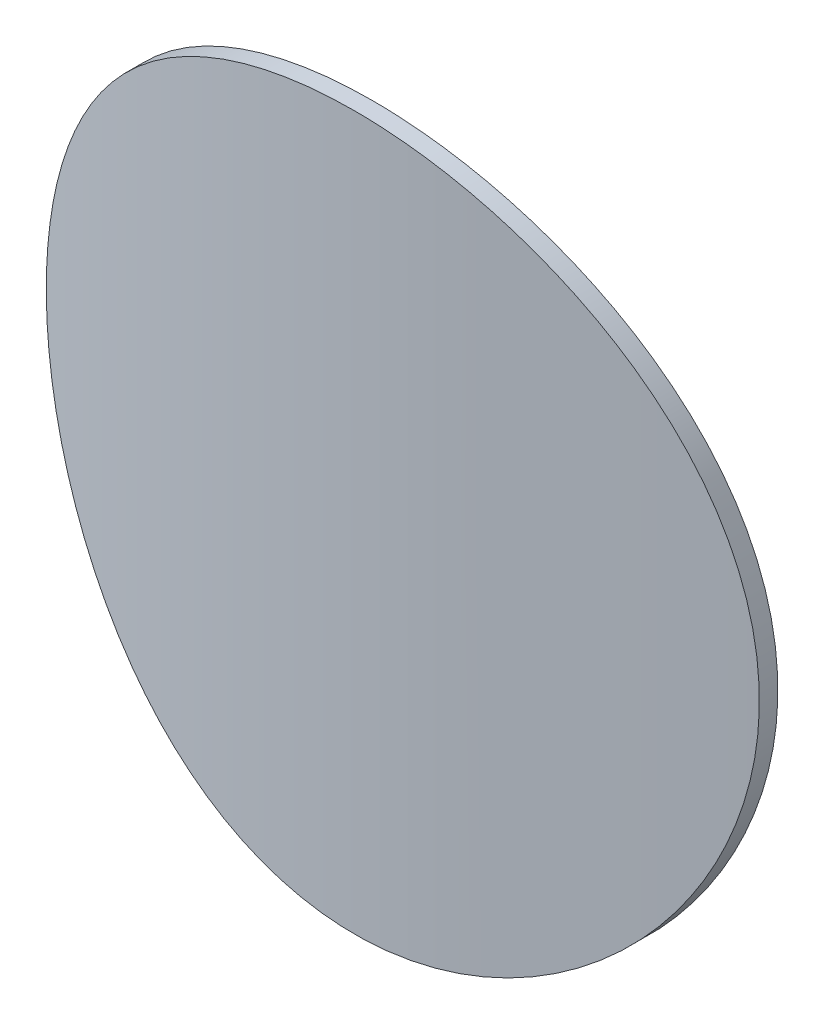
ISO-10303-21;
HEADER;
FILE_DESCRIPTION(('STEP AP214'),'2;1');
FILE_NAME('part.step','',(''),(''),'','','');
FILE_SCHEMA(('AUTOMOTIVE_DESIGN { 1 0 10303 214 1 1 1 1 }'));
ENDSEC;
DATA;
#1=APPLICATION_CONTEXT('core data for automotive mechanical design processes');
#2=APPLICATION_PROTOCOL_DEFINITION('international standard','automotive_design',2000,#1);
#3=PRODUCT_CONTEXT('',#1,'mechanical');
#4=PRODUCT('Part','Part','',(#3));
#5=PRODUCT_RELATED_PRODUCT_CATEGORY('part','',(#4));
#6=PRODUCT_DEFINITION_FORMATION('','',#4);
#7=PRODUCT_DEFINITION_CONTEXT('part definition',#1,'design');
#8=PRODUCT_DEFINITION('design','',#6,#7);
#9=PRODUCT_DEFINITION_SHAPE('','',#8);
#10=(LENGTH_UNIT() NAMED_UNIT(*) SI_UNIT(.MILLI.,.METRE.));
#11=(NAMED_UNIT(*) PLANE_ANGLE_UNIT() SI_UNIT($,.RADIAN.));
#12=(NAMED_UNIT(*) SI_UNIT($,.STERADIAN.) SOLID_ANGLE_UNIT());
#13=UNCERTAINTY_MEASURE_WITH_UNIT(LENGTH_MEASURE(1.E-05),#10,'distance_accuracy_value','');
#14=(GEOMETRIC_REPRESENTATION_CONTEXT(3) GLOBAL_UNCERTAINTY_ASSIGNED_CONTEXT((#13)) GLOBAL_UNIT_ASSIGNED_CONTEXT((#10,
#11,#12)) REPRESENTATION_CONTEXT('',''));
#15=CARTESIAN_POINT('',(0.,0.,0.));
#16=DIRECTION('',(0.,0.,1.));
#17=DIRECTION('',(1.,0.,0.));
#18=AXIS2_PLACEMENT_3D('',#15,#16,#17);
#19=CARTESIAN_POINT('',(0.,0.,63.5));
#20=DIRECTION('',(0.,0.,-1.));
#21=DIRECTION('',(-1.,0.,0.));
#22=AXIS2_PLACEMENT_3D('',#19,#20,#21);
#23=CYLINDRICAL_SURFACE('',#22,190.5);
#24=CARTESIAN_POINT('',(0.,190.5,0.));
#25=CARTESIAN_POINT('',(-2.62288411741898,190.49999868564,-7.754297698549E-07));
#26=CARTESIAN_POINT('',(-5.24582024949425,190.445819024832,-0.0145186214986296));
#27=CARTESIAN_POINT('',(-10.4871588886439,190.229204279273,-0.0724942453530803));
#28=CARTESIAN_POINT('',(-13.1055608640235,190.06675726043,-0.11595521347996));
#29=CARTESIAN_POINT('',(-18.3337459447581,189.633874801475,-0.2315387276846));
#30=CARTESIAN_POINT('',(-20.9435255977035,189.363400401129,-0.303671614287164));
#31=CARTESIAN_POINT('',(-26.1487752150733,188.715050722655,-0.476099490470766));
#32=CARTESIAN_POINT('',(-28.7442451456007,188.337175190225,-0.576394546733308));
#33=CARTESIAN_POINT('',(-33.9205032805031,187.474119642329,-0.804643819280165));
#34=CARTESIAN_POINT('',(-36.5012598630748,186.98876209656,-0.932643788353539));
#35=CARTESIAN_POINT('',(-41.6391282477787,185.912135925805,-1.21532232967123));
#36=CARTESIAN_POINT('',(-44.1962398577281,185.320866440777,-1.37000111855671));
#37=CARTESIAN_POINT('',(-49.2820039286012,184.033730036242,-1.70495579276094));
#38=CARTESIAN_POINT('',(-51.8106594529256,183.337874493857,-1.88522889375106));
#39=CARTESIAN_POINT('',(-56.8353843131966,181.842953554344,-2.27015286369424));
#40=CARTESIAN_POINT('',(-59.3314537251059,181.04388839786,-2.47480367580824));
#41=CARTESIAN_POINT('',(-64.2822161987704,179.345707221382,-2.90669939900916));
#42=CARTESIAN_POINT('',(-66.7369763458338,178.446776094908,-3.13390247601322));
#43=CARTESIAN_POINT('',(-71.6056404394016,176.549449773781,-3.60968427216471));
#44=CARTESIAN_POINT('',(-74.0195443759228,175.551054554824,-3.8582629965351));
#45=CARTESIAN_POINT('',(-78.8025474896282,173.456693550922,-4.37513853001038));
#46=CARTESIAN_POINT('',(-81.1716457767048,172.360725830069,-4.64343573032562));
#47=CARTESIAN_POINT('',(-85.861130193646,170.073284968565,-5.19795955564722));
#48=CARTESIAN_POINT('',(-88.1815163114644,168.881811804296,-5.48418618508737));
#49=CARTESIAN_POINT('',(-92.7691107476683,166.405931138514,-6.07257994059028));
#50=CARTESIAN_POINT('',(-95.0363360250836,165.121553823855,-6.37474188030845));
#51=CARTESIAN_POINT('',(-99.5150002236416,162.461683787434,-6.99313018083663));
#52=CARTESIAN_POINT('',(-101.726434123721,161.086182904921,-7.30935780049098));
#53=CARTESIAN_POINT('',(-106.089764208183,158.246602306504,-7.95376623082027));
#54=CARTESIAN_POINT('',(-108.24166269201,156.78252601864,-8.28194657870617));
#55=CARTESIAN_POINT('',(-112.482684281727,153.768214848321,-8.94812680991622));
#56=CARTESIAN_POINT('',(-114.571807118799,152.217979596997,-9.28612673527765));
#57=CARTESIAN_POINT('',(-118.727546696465,149.000237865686,-9.97696852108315));
#58=CARTESIAN_POINT('',(-120.792753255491,147.330944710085,-10.329973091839));
#59=CARTESIAN_POINT('',(-124.851065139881,143.907985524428,-11.0415209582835));
#60=CARTESIAN_POINT('',(-126.844169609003,142.154318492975,-11.4000643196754));
#61=CARTESIAN_POINT('',(-130.755088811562,138.565509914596,-12.1202474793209));
#62=CARTESIAN_POINT('',(-132.672902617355,136.730367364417,-12.4818873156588));
#63=CARTESIAN_POINT('',(-136.430112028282,132.981641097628,-13.2057845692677));
#64=CARTESIAN_POINT('',(-138.269508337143,131.068058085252,-13.5680419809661));
#65=CARTESIAN_POINT('',(-141.867248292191,127.165165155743,-14.2907583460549));
#66=CARTESIAN_POINT('',(-143.625576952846,125.175841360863,-14.6512169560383));
#67=CARTESIAN_POINT('',(-147.057927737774,121.124991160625,-15.3677791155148));
#68=CARTESIAN_POINT('',(-148.731949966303,119.063464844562,-15.7238826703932));
#69=CARTESIAN_POINT('',(-151.992982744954,114.871386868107,-16.4292777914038));
#70=CARTESIAN_POINT('',(-153.579988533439,112.740831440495,-16.7785689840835));
#71=CARTESIAN_POINT('',(-156.664041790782,108.414411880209,-17.4678366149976));
#72=CARTESIAN_POINT('',(-158.161097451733,106.218553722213,-17.8078138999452));
#73=CARTESIAN_POINT('',(-161.088086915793,101.726055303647,-18.481902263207));
#74=CARTESIAN_POINT('',(-162.516396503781,99.4283256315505,-18.8158078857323));
#75=CARTESIAN_POINT('',(-165.274714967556,94.7725683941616,-19.4690425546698));
#76=CARTESIAN_POINT('',(-166.604723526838,92.4145406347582,-19.7883715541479));
#77=CARTESIAN_POINT('',(-169.163929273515,87.6421498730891,-20.4100614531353));
#78=CARTESIAN_POINT('',(-170.39312467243,85.227785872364,-20.7124220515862));
#79=CARTESIAN_POINT('',(-172.748268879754,80.3469224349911,-21.2978706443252));
#80=CARTESIAN_POINT('',(-173.874217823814,77.8804230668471,-21.5809586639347));
#81=CARTESIAN_POINT('',(-176.020442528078,72.8999690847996,-22.1256429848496));
#82=CARTESIAN_POINT('',(-177.04073391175,70.3860215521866,-22.3872424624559));
#83=CARTESIAN_POINT('',(-178.973718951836,65.3147866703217,-22.8869574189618));
#84=CARTESIAN_POINT('',(-179.886412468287,62.7574992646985,-23.1250728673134));
#85=CARTESIAN_POINT('',(-181.602235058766,57.6042791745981,-23.5759347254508));
#86=CARTESIAN_POINT('',(-182.405366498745,55.0083473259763,-23.7886816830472));
#87=CARTESIAN_POINT('',(-183.90032746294,49.7825805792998,-24.1871121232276));
#88=CARTESIAN_POINT('',(-184.592157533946,47.1527458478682,-24.3727957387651));
#89=CARTESIAN_POINT('',(-185.848496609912,41.9243308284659,-24.7116971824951));
#90=CARTESIAN_POINT('',(-186.415546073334,39.3264024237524,-24.8655579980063));
#91=CARTESIAN_POINT('',(-187.44063685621,34.1076120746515,-25.1448054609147));
#92=CARTESIAN_POINT('',(-187.898678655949,31.4867502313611,-25.2701922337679));
#93=CARTESIAN_POINT('',(-188.704732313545,26.2269469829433,-25.4915060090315));
#94=CARTESIAN_POINT('',(-189.052745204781,23.5880057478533,-25.5874332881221));
#95=CARTESIAN_POINT('',(-189.637961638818,18.2969384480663,-25.7490712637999));
#96=CARTESIAN_POINT('',(-189.875165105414,15.6448123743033,-25.8147819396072));
#97=CARTESIAN_POINT('',(-190.23819128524,10.3327990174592,-25.9154561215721));
#98=CARTESIAN_POINT('',(-190.364032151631,7.67291307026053,-25.9504246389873));
#99=CARTESIAN_POINT('',(-190.504110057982,2.34997323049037,-25.9893540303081));
#100=CARTESIAN_POINT('',(-190.518346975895,-0.31308066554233,-25.9933148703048));
#101=CARTESIAN_POINT('',(-190.435184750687,-5.63726932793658,-25.970197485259));
#102=CARTESIAN_POINT('',(-190.337787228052,-8.29840412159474,-25.9431197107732));
#103=CARTESIAN_POINT('',(-190.031582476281,-13.6137521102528,-25.8581415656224));
#104=CARTESIAN_POINT('',(-189.822775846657,-16.2679653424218,-25.8002413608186));
#105=CARTESIAN_POINT('',(-189.301687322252,-21.4897762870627,-25.6561414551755));
#106=CARTESIAN_POINT('',(-188.992489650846,-24.0577057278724,-25.5707858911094));
#107=CARTESIAN_POINT('',(-188.269996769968,-29.1777743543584,-25.3720414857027));
#108=CARTESIAN_POINT('',(-187.8567021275,-31.7299136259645,-25.2586527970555));
#109=CARTESIAN_POINT('',(-186.926897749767,-36.8138918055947,-25.0046873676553));
#110=CARTESIAN_POINT('',(-186.410390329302,-39.34573116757,-24.8641112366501));
#111=CARTESIAN_POINT('',(-185.275226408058,-44.3848027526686,-24.556805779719));
#112=CARTESIAN_POINT('',(-184.65656973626,-46.8920349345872,-24.3900764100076));
#113=CARTESIAN_POINT('',(-183.318329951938,-51.8777640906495,-24.0316729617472));
#114=CARTESIAN_POINT('',(-182.598741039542,-54.3562594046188,-23.8399974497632));
#115=CARTESIAN_POINT('',(-181.060098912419,-59.2802141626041,-23.4330963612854));
#116=CARTESIAN_POINT('',(-180.241045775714,-61.7256736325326,-23.2178708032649));
#117=CARTESIAN_POINT('',(-178.505056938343,-66.579563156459,-22.7654067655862));
#118=CARTESIAN_POINT('',(-177.588119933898,-68.9879927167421,-22.528167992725));
#119=CARTESIAN_POINT('',(-175.658110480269,-73.7638923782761,-22.0333579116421));
#120=CARTESIAN_POINT('',(-174.645037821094,-76.1313623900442,-21.7757865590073));
#121=CARTESIAN_POINT('',(-172.512569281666,-80.848243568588,-21.2390765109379));
#122=CARTESIAN_POINT('',(-171.392095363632,-83.1971432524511,-20.9597258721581));
#123=CARTESIAN_POINT('',(-169.056783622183,-87.8454268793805,-20.3840403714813));
#124=CARTESIAN_POINT('',(-167.841945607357,-90.144810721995,-20.0877054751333));
#125=CARTESIAN_POINT('',(-165.32013081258,-94.690334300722,-19.4801315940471));
#126=CARTESIAN_POINT('',(-164.01315794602,-96.9364762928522,-19.1688932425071));
#127=CARTESIAN_POINT('',(-161.309185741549,-101.372304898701,-18.5336189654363));
#128=CARTESIAN_POINT('',(-159.91217878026,-103.561986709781,-18.2095819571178));
#129=CARTESIAN_POINT('',(-157.030524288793,-107.881440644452,-17.5509252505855));
#130=CARTESIAN_POINT('',(-155.545871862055,-110.011209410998,-17.2163049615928));
#131=CARTESIAN_POINT('',(-152.491451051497,-114.207451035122,-16.5387556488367));
#132=CARTESIAN_POINT('',(-150.921682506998,-116.2739237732,-16.1958266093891));
#133=CARTESIAN_POINT('',(-147.699486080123,-120.340525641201,-15.5039333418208));
#134=CARTESIAN_POINT('',(-146.047053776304,-122.340651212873,-15.154968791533));
#135=CARTESIAN_POINT('',(-142.662359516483,-126.271244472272,-14.4533616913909));
#136=CARTESIAN_POINT('',(-140.930103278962,-128.201717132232,-14.1007194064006));
#137=CARTESIAN_POINT('',(-137.330203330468,-132.052406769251,-13.3824496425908));
#138=CARTESIAN_POINT('',(-135.459981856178,-133.970206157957,-13.0167759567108));
#139=CARTESIAN_POINT('',(-131.640228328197,-137.725354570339,-12.2865066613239));
#140=CARTESIAN_POINT('',(-129.690695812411,-139.562703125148,-11.9219110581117));
#141=CARTESIAN_POINT('',(-125.715456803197,-143.153934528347,-11.196324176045));
#142=CARTESIAN_POINT('',(-123.689748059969,-144.907814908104,-10.8353330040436));
#143=CARTESIAN_POINT('',(-119.565524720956,-148.329072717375,-10.1194728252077));
#144=CARTESIAN_POINT('',(-117.467010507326,-149.996450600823,-9.76460378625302));
#145=CARTESIAN_POINT('',(-113.19962078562,-153.242572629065,-9.06328719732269));
#146=CARTESIAN_POINT('',(-111.030713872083,-154.821276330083,-8.71684353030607));
#147=CARTESIAN_POINT('',(-106.626993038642,-157.886450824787,-8.03494919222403));
#148=CARTESIAN_POINT('',(-104.392179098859,-159.372921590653,-7.69949852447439));
#149=CARTESIAN_POINT('',(-99.860399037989,-162.250902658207,-7.04193338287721));
#150=CARTESIAN_POINT('',(-97.5634347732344,-163.642415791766,-6.7198185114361));
#151=CARTESIAN_POINT('',(-92.9111195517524,-166.327952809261,-6.09116189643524));
#152=CARTESIAN_POINT('',(-90.5557685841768,-167.621976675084,-5.78462015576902));
#153=CARTESIAN_POINT('',(-85.7783611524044,-170.116494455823,-5.18772146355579));
#154=CARTESIAN_POINT('',(-83.3560232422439,-171.316471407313,-4.89745616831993));
#155=CARTESIAN_POINT('',(-78.4605602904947,-173.613076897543,-4.33689420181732));
#156=CARTESIAN_POINT('',(-75.9874350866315,-174.709705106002,-4.06659759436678));
#157=CARTESIAN_POINT('',(-70.9944457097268,-176.797516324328,-3.54787564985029));
#158=CARTESIAN_POINT('',(-68.4745757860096,-177.788686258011,-3.29945302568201));
#159=CARTESIAN_POINT('',(-63.3929263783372,-179.663355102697,-2.826307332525));
#160=CARTESIAN_POINT('',(-60.8311472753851,-180.54685499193,-2.60158404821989));
#161=CARTESIAN_POINT('',(-55.6751648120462,-182.202754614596,-2.17786049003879));
#162=CARTESIAN_POINT('',(-53.0810313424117,-182.975359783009,-1.97881272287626));
#163=CARTESIAN_POINT('',(-47.8604212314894,-184.409755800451,-1.60739288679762));
#164=CARTESIAN_POINT('',(-45.2339447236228,-185.071547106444,-1.43502070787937));
#165=CARTESIAN_POINT('',(-39.9546149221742,-186.282609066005,-1.11827302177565));
#166=CARTESIAN_POINT('',(-37.3017725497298,-186.831924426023,-0.973886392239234));
#167=CARTESIAN_POINT('',(-31.9739808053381,-187.817071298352,-0.71409845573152));
#168=CARTESIAN_POINT('',(-29.2990341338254,-188.25291646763,-0.598693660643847));
#169=CARTESIAN_POINT('',(-24.4128212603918,-188.942354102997,-0.415705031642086));
#170=CARTESIAN_POINT('',(-22.2043487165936,-189.214609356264,-0.343257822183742));
#171=CARTESIAN_POINT('',(-17.7791705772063,-189.681574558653,-0.218819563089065));
#172=CARTESIAN_POINT('',(-15.5624671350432,-189.876303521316,-0.166823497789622));
#173=CARTESIAN_POINT('',(-11.1232007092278,-190.188000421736,-0.0835236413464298));
#174=CARTESIAN_POINT('',(-8.90063769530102,-190.304967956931,-0.0522199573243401));
#175=CARTESIAN_POINT('',(-4.45206274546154,-190.46097772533,-0.0104552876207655));
#176=CARTESIAN_POINT('',(-2.22605010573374,-190.500001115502,6.58109707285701E-07));
#177=CARTESIAN_POINT('',(2.62288411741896,-190.49999868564,-7.7542977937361E-07));
#178=CARTESIAN_POINT('',(5.24582024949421,-190.445819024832,-0.0145186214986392));
#179=CARTESIAN_POINT('',(10.4871588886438,-190.229204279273,-0.0724942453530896));
#180=CARTESIAN_POINT('',(13.1055608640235,-190.06675726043,-0.11595521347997));
#181=CARTESIAN_POINT('',(18.3337459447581,-189.633874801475,-0.23153872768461));
#182=CARTESIAN_POINT('',(20.9435255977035,-189.363400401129,-0.303671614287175));
#183=CARTESIAN_POINT('',(26.1487752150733,-188.715050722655,-0.476099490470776));
#184=CARTESIAN_POINT('',(28.7442451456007,-188.337175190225,-0.576394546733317));
#185=CARTESIAN_POINT('',(33.9205032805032,-187.474119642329,-0.804643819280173));
#186=CARTESIAN_POINT('',(36.5012598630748,-186.98876209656,-0.932643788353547));
#187=CARTESIAN_POINT('',(41.6391282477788,-185.912135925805,-1.21532232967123));
#188=CARTESIAN_POINT('',(44.1962398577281,-185.320866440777,-1.37000111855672));
#189=CARTESIAN_POINT('',(49.2820039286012,-184.033730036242,-1.70495579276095));
#190=CARTESIAN_POINT('',(51.8106594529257,-183.337874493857,-1.88522889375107));
#191=CARTESIAN_POINT('',(56.8353843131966,-181.842953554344,-2.27015286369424));
#192=CARTESIAN_POINT('',(59.3314537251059,-181.04388839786,-2.47480367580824));
#193=CARTESIAN_POINT('',(64.2822161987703,-179.345707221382,-2.90669939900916));
#194=CARTESIAN_POINT('',(66.7369763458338,-178.446776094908,-3.13390247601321));
#195=CARTESIAN_POINT('',(71.6056404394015,-176.549449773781,-3.6096842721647));
#196=CARTESIAN_POINT('',(74.0195443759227,-175.551054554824,-3.85826299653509));
#197=CARTESIAN_POINT('',(78.8025474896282,-173.456693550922,-4.37513853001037));
#198=CARTESIAN_POINT('',(81.1716457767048,-172.360725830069,-4.64343573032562));
#199=CARTESIAN_POINT('',(85.861130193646,-170.073284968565,-5.19795955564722));
#200=CARTESIAN_POINT('',(88.1815163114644,-168.881811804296,-5.48418618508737));
#201=CARTESIAN_POINT('',(92.7691107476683,-166.405931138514,-6.07257994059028));
#202=CARTESIAN_POINT('',(95.0363360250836,-165.121553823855,-6.37474188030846));
#203=CARTESIAN_POINT('',(99.5150002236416,-162.461683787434,-6.99313018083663));
#204=CARTESIAN_POINT('',(101.726434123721,-161.08618290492,-7.30935780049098));
#205=CARTESIAN_POINT('',(106.089764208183,-158.246602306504,-7.95376623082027));
#206=CARTESIAN_POINT('',(108.24166269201,-156.78252601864,-8.28194657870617));
#207=CARTESIAN_POINT('',(112.482684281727,-153.768214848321,-8.94812680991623));
#208=CARTESIAN_POINT('',(114.571807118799,-152.217979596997,-9.28612673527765));
#209=CARTESIAN_POINT('',(118.727546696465,-149.000237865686,-9.97696852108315));
#210=CARTESIAN_POINT('',(120.792753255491,-147.330944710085,-10.329973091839));
#211=CARTESIAN_POINT('',(124.851065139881,-143.907985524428,-11.0415209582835));
#212=CARTESIAN_POINT('',(126.844169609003,-142.154318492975,-11.4000643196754));
#213=CARTESIAN_POINT('',(130.755088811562,-138.565509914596,-12.1202474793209));
#214=CARTESIAN_POINT('',(132.672902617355,-136.730367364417,-12.4818873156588));
#215=CARTESIAN_POINT('',(136.430112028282,-132.981641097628,-13.2057845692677));
#216=CARTESIAN_POINT('',(138.269508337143,-131.068058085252,-13.5680419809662));
#217=CARTESIAN_POINT('',(141.867248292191,-127.165165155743,-14.2907583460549));
#218=CARTESIAN_POINT('',(143.625576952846,-125.175841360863,-14.6512169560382));
#219=CARTESIAN_POINT('',(147.057927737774,-121.124991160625,-15.3677791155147));
#220=CARTESIAN_POINT('',(148.731949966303,-119.063464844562,-15.7238826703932));
#221=CARTESIAN_POINT('',(151.992982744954,-114.871386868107,-16.4292777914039));
#222=CARTESIAN_POINT('',(153.579988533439,-112.740831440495,-16.7785689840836));
#223=CARTESIAN_POINT('',(156.664041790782,-108.414411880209,-17.4678366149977));
#224=CARTESIAN_POINT('',(158.161097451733,-106.218553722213,-17.8078138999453));
#225=CARTESIAN_POINT('',(161.088086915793,-101.726055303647,-18.481902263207));
#226=CARTESIAN_POINT('',(162.516396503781,-99.4283256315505,-18.8158078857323));
#227=CARTESIAN_POINT('',(165.274714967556,-94.7725683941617,-19.4690425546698));
#228=CARTESIAN_POINT('',(166.604723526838,-92.4145406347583,-19.7883715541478));
#229=CARTESIAN_POINT('',(169.163929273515,-87.6421498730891,-20.4100614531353));
#230=CARTESIAN_POINT('',(170.39312467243,-85.227785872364,-20.7124220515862));
#231=CARTESIAN_POINT('',(172.748268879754,-80.3469224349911,-21.2978706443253));
#232=CARTESIAN_POINT('',(173.874217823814,-77.8804230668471,-21.5809586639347));
#233=CARTESIAN_POINT('',(176.020442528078,-72.8999690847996,-22.1256429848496));
#234=CARTESIAN_POINT('',(177.04073391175,-70.3860215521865,-22.3872424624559));
#235=CARTESIAN_POINT('',(178.973718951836,-65.3147866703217,-22.8869574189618));
#236=CARTESIAN_POINT('',(179.886412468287,-62.7574992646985,-23.1250728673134));
#237=CARTESIAN_POINT('',(181.602235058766,-57.604279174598,-23.5759347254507));
#238=CARTESIAN_POINT('',(182.405366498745,-55.0083473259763,-23.7886816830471));
#239=CARTESIAN_POINT('',(183.900327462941,-49.7825805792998,-24.1871121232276));
#240=CARTESIAN_POINT('',(184.592157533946,-47.1527458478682,-24.3727957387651));
#241=CARTESIAN_POINT('',(185.848496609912,-41.9243308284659,-24.7116971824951));
#242=CARTESIAN_POINT('',(186.415546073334,-39.3264024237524,-24.8655579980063));
#243=CARTESIAN_POINT('',(187.44063685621,-34.1076120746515,-25.1448054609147));
#244=CARTESIAN_POINT('',(187.898678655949,-31.4867502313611,-25.2701922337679));
#245=CARTESIAN_POINT('',(188.704732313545,-26.2269469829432,-25.4915060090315));
#246=CARTESIAN_POINT('',(189.052745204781,-23.5880057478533,-25.5874332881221));
#247=CARTESIAN_POINT('',(189.637961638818,-18.2969384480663,-25.7490712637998));
#248=CARTESIAN_POINT('',(189.875165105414,-15.6448123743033,-25.8147819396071));
#249=CARTESIAN_POINT('',(190.23819128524,-10.3327990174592,-25.9154561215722));
#250=CARTESIAN_POINT('',(190.364032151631,-7.67291307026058,-25.9504246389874));
#251=CARTESIAN_POINT('',(190.504110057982,-2.34997323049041,-25.9893540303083));
#252=CARTESIAN_POINT('',(190.518346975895,0.313080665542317,-25.9933148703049));
#253=CARTESIAN_POINT('',(190.435184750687,5.63726932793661,-25.970197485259));
#254=CARTESIAN_POINT('',(190.337787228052,8.29840412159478,-25.9431197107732));
#255=CARTESIAN_POINT('',(190.031582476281,13.6137521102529,-25.8581415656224));
#256=CARTESIAN_POINT('',(189.822775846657,16.2679653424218,-25.8002413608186));
#257=CARTESIAN_POINT('',(189.301687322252,21.4897762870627,-25.6561414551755));
#258=CARTESIAN_POINT('',(188.992489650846,24.0577057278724,-25.5707858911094));
#259=CARTESIAN_POINT('',(188.269996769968,29.1777743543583,-25.3720414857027));
#260=CARTESIAN_POINT('',(187.8567021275,31.7299136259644,-25.2586527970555));
#261=CARTESIAN_POINT('',(186.926897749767,36.8138918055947,-25.0046873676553));
#262=CARTESIAN_POINT('',(186.410390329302,39.3457311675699,-24.8641112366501));
#263=CARTESIAN_POINT('',(185.275226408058,44.3848027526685,-24.556805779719));
#264=CARTESIAN_POINT('',(184.65656973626,46.8920349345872,-24.3900764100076));
#265=CARTESIAN_POINT('',(183.318329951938,51.8777640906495,-24.0316729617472));
#266=CARTESIAN_POINT('',(182.598741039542,54.3562594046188,-23.8399974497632));
#267=CARTESIAN_POINT('',(181.060098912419,59.280214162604,-23.4330963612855));
#268=CARTESIAN_POINT('',(180.241045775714,61.7256736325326,-23.2178708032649));
#269=CARTESIAN_POINT('',(178.505056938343,66.579563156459,-22.7654067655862));
#270=CARTESIAN_POINT('',(177.588119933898,68.9879927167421,-22.528167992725));
#271=CARTESIAN_POINT('',(175.658110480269,73.7638923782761,-22.0333579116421));
#272=CARTESIAN_POINT('',(174.645037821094,76.1313623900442,-21.7757865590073));
#273=CARTESIAN_POINT('',(172.512569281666,80.848243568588,-21.2390765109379));
#274=CARTESIAN_POINT('',(171.392095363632,83.1971432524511,-20.959725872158));
#275=CARTESIAN_POINT('',(169.056783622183,87.8454268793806,-20.3840403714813));
#276=CARTESIAN_POINT('',(167.841945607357,90.144810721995,-20.0877054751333));
#277=CARTESIAN_POINT('',(165.32013081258,94.690334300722,-19.4801315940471));
#278=CARTESIAN_POINT('',(164.01315794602,96.9364762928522,-19.1688932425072));
#279=CARTESIAN_POINT('',(161.309185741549,101.372304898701,-18.5336189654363));
#280=CARTESIAN_POINT('',(159.91217878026,103.561986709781,-18.2095819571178));
#281=CARTESIAN_POINT('',(157.030524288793,107.881440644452,-17.5509252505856));
#282=CARTESIAN_POINT('',(155.545871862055,110.011209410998,-17.2163049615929));
#283=CARTESIAN_POINT('',(152.491451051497,114.207451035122,-16.5387556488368));
#284=CARTESIAN_POINT('',(150.921682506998,116.2739237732,-16.195826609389));
#285=CARTESIAN_POINT('',(147.699486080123,120.340525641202,-15.5039333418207));
#286=CARTESIAN_POINT('',(146.047053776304,122.340651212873,-15.154968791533));
#287=CARTESIAN_POINT('',(142.662359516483,126.271244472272,-14.4533616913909));
#288=CARTESIAN_POINT('',(140.930103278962,128.201717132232,-14.1007194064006));
#289=CARTESIAN_POINT('',(137.330203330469,132.052406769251,-13.3824496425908));
#290=CARTESIAN_POINT('',(135.459981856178,133.970206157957,-13.0167759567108));
#291=CARTESIAN_POINT('',(131.640228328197,137.725354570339,-12.286506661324));
#292=CARTESIAN_POINT('',(129.690695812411,139.562703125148,-11.9219110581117));
#293=CARTESIAN_POINT('',(125.715456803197,143.153934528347,-11.196324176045));
#294=CARTESIAN_POINT('',(123.689748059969,144.907814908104,-10.8353330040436));
#295=CARTESIAN_POINT('',(119.565524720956,148.329072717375,-10.1194728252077));
#296=CARTESIAN_POINT('',(117.467010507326,149.996450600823,-9.76460378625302));
#297=CARTESIAN_POINT('',(113.199620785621,153.242572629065,-9.06328719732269));
#298=CARTESIAN_POINT('',(111.030713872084,154.821276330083,-8.71684353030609));
#299=CARTESIAN_POINT('',(106.626993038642,157.886450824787,-8.03494919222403));
#300=CARTESIAN_POINT('',(104.392179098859,159.372921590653,-7.69949852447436));
#301=CARTESIAN_POINT('',(99.860399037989,162.250902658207,-7.04193338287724));
#302=CARTESIAN_POINT('',(97.5634347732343,163.642415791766,-6.71981851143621));
#303=CARTESIAN_POINT('',(92.9111195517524,166.327952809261,-6.09116189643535));
#304=CARTESIAN_POINT('',(90.5557685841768,167.621976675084,-5.78462015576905));
#305=CARTESIAN_POINT('',(85.7783611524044,170.116494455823,-5.18772146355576));
#306=CARTESIAN_POINT('',(83.3560232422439,171.316471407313,-4.89745616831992));
#307=CARTESIAN_POINT('',(78.4605602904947,173.613076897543,-4.33689420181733));
#308=CARTESIAN_POINT('',(75.9874350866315,174.709705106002,-4.06659759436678));
#309=CARTESIAN_POINT('',(70.9944457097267,176.797516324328,-3.54787564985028));
#310=CARTESIAN_POINT('',(68.4745757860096,177.788686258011,-3.299453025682));
#311=CARTESIAN_POINT('',(63.3929263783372,179.663355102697,-2.82630733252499));
#312=CARTESIAN_POINT('',(60.8311472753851,180.54685499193,-2.60158404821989));
#313=CARTESIAN_POINT('',(55.6751648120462,182.202754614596,-2.17786049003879));
#314=CARTESIAN_POINT('',(53.0810313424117,182.975359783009,-1.97881272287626));
#315=CARTESIAN_POINT('',(47.8604212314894,184.409755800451,-1.60739288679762));
#316=CARTESIAN_POINT('',(45.2339447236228,185.071547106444,-1.43502070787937));
#317=CARTESIAN_POINT('',(39.9546149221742,186.282609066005,-1.11827302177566));
#318=CARTESIAN_POINT('',(37.3017725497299,186.831924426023,-0.97388639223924));
#319=CARTESIAN_POINT('',(31.9739808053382,187.817071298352,-0.714098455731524));
#320=CARTESIAN_POINT('',(29.2990341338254,188.25291646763,-0.598693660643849));
#321=CARTESIAN_POINT('',(24.4128212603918,188.942354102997,-0.415705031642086));
#322=CARTESIAN_POINT('',(22.2043487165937,189.214609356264,-0.343257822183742));
#323=CARTESIAN_POINT('',(17.7791705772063,189.681574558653,-0.218819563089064));
#324=CARTESIAN_POINT('',(15.5624671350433,189.876303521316,-0.166823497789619));
#325=CARTESIAN_POINT('',(11.1232007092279,190.188000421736,-0.0835236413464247));
#326=CARTESIAN_POINT('',(8.90063769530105,190.304967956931,-0.052219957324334));
#327=CARTESIAN_POINT('',(4.45206274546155,190.46097772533,-0.0104552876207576));
#328=CARTESIAN_POINT('',(2.22605010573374,190.500001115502,6.58109715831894E-07));
#329=CARTESIAN_POINT('',(0.,190.5,0.));
#330=B_SPLINE_CURVE_WITH_KNOTS('',3,(#24,#25,#26,#27,#28,#29,#30,#31,#32,#33,#34,#35,#36,#37,
#38,#39,#40,#41,#42,#43,#44,#45,#46,#47,#48,#49,#50,#51,#52,#53,#54,#55,#56,#57,#58,#59,#60,#61,
#62,#63,#64,#65,#66,#67,#68,#69,#70,#71,#72,#73,#74,#75,#76,#77,#78,#79,#80,#81,#82,#83,#84,#85,
#86,#87,#88,#89,#90,#91,#92,#93,#94,#95,#96,#97,#98,#99,#100,#101,#102,#103,#104,#105,#106,#107,
#108,#109,#110,#111,#112,#113,#114,#115,#116,#117,#118,#119,#120,#121,#122,#123,#124,#125,#126,
#127,#128,#129,#130,#131,#132,#133,#134,#135,#136,#137,#138,#139,#140,#141,#142,#143,#144,#145,
#146,#147,#148,#149,#150,#151,#152,#153,#154,#155,#156,#157,#158,#159,#160,#161,#162,#163,#164,
#165,#166,#167,#168,#169,#170,#171,#172,#173,#174,#175,#176,#177,#178,#179,#180,#181,#182,#183,
#184,#185,#186,#187,#188,#189,#190,#191,#192,#193,#194,#195,#196,#197,#198,#199,#200,#201,#202,
#203,#204,#205,#206,#207,#208,#209,#210,#211,#212,#213,#214,#215,#216,#217,#218,#219,#220,#221,
#222,#223,#224,#225,#226,#227,#228,#229,#230,#231,#232,#233,#234,#235,#236,#237,#238,#239,#240,
#241,#242,#243,#244,#245,#246,#247,#248,#249,#250,#251,#252,#253,#254,#255,#256,#257,#258,#259,
#260,#261,#262,#263,#264,#265,#266,#267,#268,#269,#270,#271,#272,#273,#274,#275,#276,#277,#278,
#279,#280,#281,#282,#283,#284,#285,#286,#287,#288,#289,#290,#291,#292,#293,#294,#295,#296,#297,
#298,#299,#300,#301,#302,#303,#304,#305,#306,#307,#308,#309,#310,#311,#312,#313,#314,#315,#316,
#317,#318,#319,#320,#321,#322,#323,#324,#325,#326,#327,#328,#329),.UNSPECIFIED.,.T.,.F.,(4,2,2,
2,2,2,2,2,2,2,2,2,2,2,2,2,2,2,2,2,2,2,2,2,2,2,2,2,2,2,2,2,2,2,2,2,2,2,2,2,2,2,2,2,2,2,2,2,2,2,2,
2,2,2,2,2,2,2,2,2,2,2,2,2,2,2,2,2,2,2,2,2,2,2,2,2,2,2,2,2,2,2,2,2,2,2,2,2,2,2,2,2,2,2,2,2,2,2,2,
2,2,2,2,2,2,2,2,2,2,2,2,2,2,2,2,2,2,2,2,2,2,2,2,2,2,2,2,2,2,2,2,2,2,2,2,2,2,2,2,2,2,2,2,2,2,2,2,
2,2,2,2,2,4),(0.,7.86814328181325,15.7371539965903,23.6090052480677,31.4808751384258,
39.3658454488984,47.2508797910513,55.1350570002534,63.0192158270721,70.8890136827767,
78.7588134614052,86.628769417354,94.4987273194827,102.366139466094,110.234257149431,
118.102070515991,125.969917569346,134.004145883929,142.038469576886,150.072892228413,
158.107242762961,166.143072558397,174.178892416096,182.215151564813,190.250677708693,
198.426227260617,206.601803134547,214.777524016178,222.953234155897,231.127733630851,
239.302243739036,247.476577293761,255.650870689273,263.63903090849,271.62715593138,
279.615205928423,287.603261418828,295.590014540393,303.576776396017,311.563422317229,
319.550025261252,327.311394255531,335.072720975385,342.833873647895,350.595039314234,
358.356651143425,366.11825688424,373.879966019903,381.641692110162,389.491679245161,
397.341682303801,405.191352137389,413.041687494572,420.892461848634,428.743251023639,
436.594460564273,444.445108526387,452.553505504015,460.661949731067,468.770633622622,
476.879274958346,484.991585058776,493.103897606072,501.215968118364,509.328040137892,
517.481962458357,525.635910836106,533.790869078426,541.945753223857,550.085329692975,
558.224872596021,566.361173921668,574.496495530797,581.17420421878,587.850274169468,
594.526378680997,601.204096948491,609.072240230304,616.941250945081,624.813102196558,
632.684972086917,640.569942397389,648.454976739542,656.339153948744,664.223312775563,
672.093110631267,679.962910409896,687.832866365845,695.702824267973,703.570236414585,
711.438354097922,719.306167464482,727.174014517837,735.20824283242,743.242566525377,
751.276989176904,759.311339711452,767.347169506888,775.382989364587,783.419248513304,
791.454774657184,799.630324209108,807.805900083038,815.98162096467,824.157331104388,
832.331830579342,840.506340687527,848.680674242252,856.854967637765,864.843127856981,
872.831252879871,880.819302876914,888.807358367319,896.794111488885,904.780873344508,
912.767519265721,920.754122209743,928.515491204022,936.276817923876,944.037970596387,
951.799136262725,959.560748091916,967.322353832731,975.084062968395,982.845789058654,
990.695776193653,998.545779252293,1006.39544908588,1014.24578444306,1022.09655879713,
1029.94734797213,1037.79855751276,1045.64920547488,1053.75760245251,1061.86604667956,
1069.97473057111,1078.08337190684,1086.19568200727,1094.30799455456,1102.42006506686,
1110.53213708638,1118.68605940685,1126.8400077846,1134.99496602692,1143.14985017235,
1151.28942664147,1159.42896954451,1167.56527087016,1175.70059247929,1182.37830116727,
1189.05437111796,1195.73047562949,1202.40819389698),.UNSPECIFIED.);
#331=CARTESIAN_POINT('',(0.,190.5,0.));
#332=VERTEX_POINT('',#331);
#333=EDGE_CURVE('E44',#332,#332,#330,.T.);
#334=ORIENTED_EDGE('',*,*,#333,.T.);
#335=EDGE_LOOP('',(#334));
#336=FACE_BOUND('',#335,.T.);
#337=CARTESIAN_POINT('',(0.,190.5,9.52500000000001));
#338=CARTESIAN_POINT('',(-2.62419411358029,190.499998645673,9.52499920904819));
#339=CARTESIAN_POINT('',(-5.24844228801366,190.445764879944,9.5106589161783));
#340=CARTESIAN_POINT('',(-10.4924065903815,190.228933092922,9.45339231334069));
#341=CARTESIAN_POINT('',(-13.112122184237,190.066323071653,9.41046283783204));
#342=CARTESIAN_POINT('',(-18.3429421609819,189.633003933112,9.29629289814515));
#343=CARTESIAN_POINT('',(-20.9540430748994,189.362255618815,9.22504216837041));
#344=CARTESIAN_POINT('',(-26.1619374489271,188.713245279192,9.05472338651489));
#345=CARTESIAN_POINT('',(-28.7587308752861,188.334983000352,8.95565526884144));
#346=CARTESIAN_POINT('',(-33.9376608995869,187.471034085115,8.73019806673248));
#347=CARTESIAN_POINT('',(-36.5197657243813,186.985168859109,8.60376357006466));
#348=CARTESIAN_POINT('',(-41.6603301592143,185.907406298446,8.32454335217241));
#349=CARTESIAN_POINT('',(-44.2187895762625,185.315508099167,8.17175741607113));
#350=CARTESIAN_POINT('',(-49.3072439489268,184.026990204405,7.84090366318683));
#351=CARTESIAN_POINT('',(-51.83724198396,183.330381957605,7.66283861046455));
#352=CARTESIAN_POINT('',(-56.8646434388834,181.83382782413,7.28263225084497));
#353=CARTESIAN_POINT('',(-59.3620469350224,181.033882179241,7.08049100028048));
#354=CARTESIAN_POINT('',(-64.3155213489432,179.333789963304,6.65389046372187));
#355=CARTESIAN_POINT('',(-66.7716584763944,178.433826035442,6.4294719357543));
#356=CARTESIAN_POINT('',(-71.6430522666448,176.534296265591,5.95952661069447));
#357=CARTESIAN_POINT('',(-74.0583089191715,175.534730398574,5.71399980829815));
#358=CARTESIAN_POINT('',(-78.8439844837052,173.437888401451,5.20347764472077));
#359=CARTESIAN_POINT('',(-81.2144024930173,172.340610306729,4.93848189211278));
#360=CARTESIAN_POINT('',(-85.9064819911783,170.050408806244,4.39079156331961));
#361=CARTESIAN_POINT('',(-88.2281434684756,168.857485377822,4.10809698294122));
#362=CARTESIAN_POINT('',(-92.8182210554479,166.378571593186,3.52697824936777));
#363=CARTESIAN_POINT('',(-95.086654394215,165.092611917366,3.22855929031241));
#364=CARTESIAN_POINT('',(-99.5676667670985,162.429441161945,2.61784723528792));
#365=CARTESIAN_POINT('',(-101.780240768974,161.052221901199,2.30555289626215));
#366=CARTESIAN_POINT('',(-106.145768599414,158.209073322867,1.66917946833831));
#367=CARTESIAN_POINT('',(-108.298724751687,156.743147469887,1.34510083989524));
#368=CARTESIAN_POINT('',(-112.541766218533,153.725011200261,0.687270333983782));
#369=CARTESIAN_POINT('',(-114.631851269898,152.172800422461,0.353518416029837));
#370=CARTESIAN_POINT('',(-118.788372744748,148.951761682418,-0.328440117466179));
#371=CARTESIAN_POINT('',(-120.853431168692,147.281188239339,-0.676802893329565));
#372=CARTESIAN_POINT('',(-124.91139229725,143.855637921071,-1.3789592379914));
#373=CARTESIAN_POINT('',(-126.904294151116,142.100660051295,-1.73275287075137));
#374=CARTESIAN_POINT('',(-130.814743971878,138.509206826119,-2.44335793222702));
#375=CARTESIAN_POINT('',(-132.732291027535,136.672730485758,-2.80016939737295));
#376=CARTESIAN_POINT('',(-136.488894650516,132.921322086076,-3.51436154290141));
#377=CARTESIAN_POINT('',(-138.327951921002,131.006390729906,-3.87174221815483));
#378=CARTESIAN_POINT('',(-141.924927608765,127.100803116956,-4.58468535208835));
#379=CARTESIAN_POINT('',(-143.682831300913,125.110133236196,-4.94024747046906));
#380=CARTESIAN_POINT('',(-147.114246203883,121.056598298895,-5.64703045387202));
#381=CARTESIAN_POINT('',(-148.787757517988,118.993733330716,-5.9982513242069));
#382=CARTESIAN_POINT('',(-152.047677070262,114.798998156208,-6.69392653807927));
#383=CARTESIAN_POINT('',(-153.634080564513,112.66712420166,-7.03838051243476));
#384=CARTESIAN_POINT('',(-156.716835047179,108.338100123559,-7.71805250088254));
#385=CARTESIAN_POINT('',(-158.213194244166,106.140955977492,-8.05327135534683));
#386=CARTESIAN_POINT('',(-161.137934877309,101.647057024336,-8.71770238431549));
#387=CARTESIAN_POINT('',(-162.564738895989,99.3492460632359,-9.04671712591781));
#388=CARTESIAN_POINT('',(-165.320048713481,94.6934452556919,-9.69033595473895));
#389=CARTESIAN_POINT('',(-166.648554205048,92.3354552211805,-10.0049399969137));
#390=CARTESIAN_POINT('',(-169.204762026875,87.5632662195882,-10.6173841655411));
#391=CARTESIAN_POINT('',(-170.432462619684,85.1490662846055,-10.9152240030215));
#392=CARTESIAN_POINT('',(-172.784634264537,80.2686607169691,-11.4918735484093));
#393=CARTESIAN_POINT('',(-173.909105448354,77.8024551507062,-11.7706832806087));
#394=CARTESIAN_POINT('',(-176.05240564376,72.8227112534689,-12.3070923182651));
#395=CARTESIAN_POINT('',(-177.071249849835,70.309179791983,-12.5646946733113));
#396=CARTESIAN_POINT('',(-179.001376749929,65.2389097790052,-13.0567305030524));
#397=CARTESIAN_POINT('',(-179.912659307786,62.682171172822,-13.2911639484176));
#398=CARTESIAN_POINT('',(-181.625708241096,57.5301775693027,-13.7350111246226));
#399=CARTESIAN_POINT('',(-182.427476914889,54.9349233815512,-13.9444253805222));
#400=CARTESIAN_POINT('',(-183.919771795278,49.7106372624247,-14.3365711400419));
#401=CARTESIAN_POINT('',(-184.610298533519,47.0816054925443,-14.519302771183));
#402=CARTESIAN_POINT('',(-185.864481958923,41.8534307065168,-14.8528655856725));
#403=CARTESIAN_POINT('',(-186.430616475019,39.254921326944,-15.0043153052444));
#404=CARTESIAN_POINT('',(-187.453831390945,34.0350482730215,-15.2791227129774));
#405=CARTESIAN_POINT('',(-187.910912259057,31.4136846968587,-15.4024805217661));
#406=CARTESIAN_POINT('',(-188.715005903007,26.1529529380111,-15.6201370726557));
#407=CARTESIAN_POINT('',(-189.062019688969,23.5135849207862,-15.7144360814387));
#408=CARTESIAN_POINT('',(-189.645206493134,18.2217339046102,-15.8732331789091));
#409=CARTESIAN_POINT('',(-189.881379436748,15.5692508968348,-15.9377312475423));
#410=CARTESIAN_POINT('',(-190.242319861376,10.256574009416,-16.036407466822));
#411=CARTESIAN_POINT('',(-190.367104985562,7.59638141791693,-16.0705904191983));
#412=CARTESIAN_POINT('',(-190.50504892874,2.27288262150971,-16.1083822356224));
#413=CARTESIAN_POINT('',(-190.518207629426,-0.390423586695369,-16.1119910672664));
#414=CARTESIAN_POINT('',(-190.432869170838,-5.71507268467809,-16.0886061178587));
#415=CARTESIAN_POINT('',(-190.334373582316,-8.37641560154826,-16.0616127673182));
#416=CARTESIAN_POINT('',(-190.025953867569,-13.6921435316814,-15.9772385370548));
#417=CARTESIAN_POINT('',(-189.816030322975,-16.3465285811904,-15.9198578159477));
#418=CARTESIAN_POINT('',(-189.292506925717,-21.570780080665,-15.7771474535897));
#419=CARTESIAN_POINT('',(-188.981905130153,-24.1409696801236,-15.6926266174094));
#420=CARTESIAN_POINT('',(-188.256412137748,-29.2655091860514,-15.4959033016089));
#421=CARTESIAN_POINT('',(-187.841521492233,-31.8198591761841,-15.3837009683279));
#422=CARTESIAN_POINT('',(-186.908332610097,-36.9082053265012,-15.1324499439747));
#423=CARTESIAN_POINT('',(-186.390036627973,-39.4422019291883,-14.9934018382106));
#424=CARTESIAN_POINT('',(-185.251102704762,-44.4855262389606,-14.6894818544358));
#425=CARTESIAN_POINT('',(-184.630464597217,-46.9948539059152,-14.5246099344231));
#426=CARTESIAN_POINT('',(-183.288069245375,-51.9847018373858,-14.1702365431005));
#427=CARTESIAN_POINT('',(-182.566306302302,-54.4652204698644,-13.9807336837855));
#428=CARTESIAN_POINT('',(-181.023122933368,-59.3931430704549,-13.5784763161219));
#429=CARTESIAN_POINT('',(-180.201702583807,-61.840547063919,-13.3657218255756));
#430=CARTESIAN_POINT('',(-178.46078702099,-66.6982352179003,-12.9184803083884));
#431=CARTESIAN_POINT('',(-177.541290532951,-69.1085188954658,-12.6839929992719));
#432=CARTESIAN_POINT('',(-175.605971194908,-73.8880248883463,-12.1949466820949));
#433=CARTESIAN_POINT('',(-174.590148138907,-76.2572471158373,-11.9403876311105));
#434=CARTESIAN_POINT('',(-172.452227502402,-80.9769423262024,-11.4100449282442));
#435=CARTESIAN_POINT('',(-171.329073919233,-83.3269139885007,-11.1340567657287));
#436=CARTESIAN_POINT('',(-168.988261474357,-87.9772343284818,-10.5653279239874));
#437=CARTESIAN_POINT('',(-167.77060242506,-90.277582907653,-10.2725872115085));
#438=CARTESIAN_POINT('',(-165.243008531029,-94.8249155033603,-9.67240908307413));
#439=CARTESIAN_POINT('',(-163.933077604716,-97.07190178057,-9.36497229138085));
#440=CARTESIAN_POINT('',(-161.223057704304,-101.509284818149,-8.73748438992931));
#441=CARTESIAN_POINT('',(-159.822961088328,-103.699676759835,-8.41743221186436));
#442=CARTESIAN_POINT('',(-156.935009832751,-108.020392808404,-7.76690496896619));
#443=CARTESIAN_POINT('',(-155.447150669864,-110.15071381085,-7.4364293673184));
#444=CARTESIAN_POINT('',(-152.386203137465,-114.34789706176,-6.76730278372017));
#445=CARTESIAN_POINT('',(-150.813114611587,-116.41475919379,-6.42865178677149));
#446=CARTESIAN_POINT('',(-147.584176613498,-120.481962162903,-5.74542337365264));
#447=CARTESIAN_POINT('',(-145.928322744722,-122.482299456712,-5.40084564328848));
#448=CARTESIAN_POINT('',(-142.536696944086,-126.413125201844,-4.70809550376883));
#449=CARTESIAN_POINT('',(-140.800930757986,-128.343618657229,-4.35992335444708));
#450=CARTESIAN_POINT('',(-137.195423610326,-132.192432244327,-3.65111572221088));
#451=CARTESIAN_POINT('',(-135.323174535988,-134.108395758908,-3.29043723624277));
#452=CARTESIAN_POINT('',(-131.499440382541,-137.859786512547,-2.57018997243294));
#453=CARTESIAN_POINT('',(-129.547954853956,-139.695213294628,-2.21062120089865));
#454=CARTESIAN_POINT('',(-125.568895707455,-143.282511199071,-1.49508647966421));
#455=CARTESIAN_POINT('',(-123.541319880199,-145.034379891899,-1.13912063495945));
#456=CARTESIAN_POINT('',(-119.413458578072,-148.451523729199,-0.433276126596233));
#457=CARTESIAN_POINT('',(-117.313173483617,-150.116799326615,-0.0833974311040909));
#458=CARTESIAN_POINT('',(-113.042348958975,-153.358625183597,0.608003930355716));
#459=CARTESIAN_POINT('',(-110.871778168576,-154.935134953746,0.949522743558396));
#460=CARTESIAN_POINT('',(-106.464849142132,-157.995832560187,1.62166746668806));
#461=CARTESIAN_POINT('',(-104.228490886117,-159.480020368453,1.95229337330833));
#462=CARTESIAN_POINT('',(-99.6937532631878,-162.353350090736,2.60034103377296));
#463=CARTESIAN_POINT('',(-97.3953757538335,-163.742494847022,2.9177631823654));
#464=CARTESIAN_POINT('',(-92.7403754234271,-166.423215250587,3.53719748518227));
#465=CARTESIAN_POINT('',(-90.383752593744,-167.714790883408,3.83920963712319));
#466=CARTESIAN_POINT('',(-85.6044422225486,-170.204068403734,4.4271588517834));
#467=CARTESIAN_POINT('',(-83.181485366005,-171.401273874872,4.71300892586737));
#468=CARTESIAN_POINT('',(-78.2849648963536,-173.692315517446,5.26497468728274));
#469=CARTESIAN_POINT('',(-75.8114011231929,-174.786151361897,5.53109031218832));
#470=CARTESIAN_POINT('',(-70.8177181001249,-176.868368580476,6.0417141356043));
#471=CARTESIAN_POINT('',(-68.2975931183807,-177.856736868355,6.2862196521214));
#472=CARTESIAN_POINT('',(-63.215618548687,-179.72580626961,6.75182417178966));
#473=CARTESIAN_POINT('',(-60.6537693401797,-180.606508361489,6.97292338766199));
#474=CARTESIAN_POINT('',(-55.4978357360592,-182.256833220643,7.38972477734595));
#475=CARTESIAN_POINT('',(-52.9038209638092,-183.026661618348,7.58547389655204));
#476=CARTESIAN_POINT('',(-47.6836274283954,-184.455535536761,7.95064002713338));
#477=CARTESIAN_POINT('',(-45.0574487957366,-185.114581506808,8.12005714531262));
#478=CARTESIAN_POINT('',(-39.7788900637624,-186.320198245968,8.43126173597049));
#479=CARTESIAN_POINT('',(-37.126520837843,-186.866813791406,8.57306020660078));
#480=CARTESIAN_POINT('',(-31.7998393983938,-187.846619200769,8.82805778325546));
#481=CARTESIAN_POINT('',(-29.1255298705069,-188.279822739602,8.94126033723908));
#482=CARTESIAN_POINT('',(-24.254105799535,-188.962623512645,9.12011054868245));
#483=CARTESIAN_POINT('',(-22.0598291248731,-189.231342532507,9.19067688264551));
#484=CARTESIAN_POINT('',(-17.6632221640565,-189.692237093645,9.31188113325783));
#485=CARTESIAN_POINT('',(-15.4608939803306,-189.884431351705,9.36252392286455));
#486=CARTESIAN_POINT('',(-11.0505022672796,-190.192068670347,9.44365437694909));
#487=CARTESIAN_POINT('',(-8.84243870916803,-190.307511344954,9.4741419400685));
#488=CARTESIAN_POINT('',(-4.42293002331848,-190.46148685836,9.51481753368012));
#489=CARTESIAN_POINT('',(-2.21148420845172,-190.50000114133,9.52500066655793));
#490=CARTESIAN_POINT('',(2.62419411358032,-190.499998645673,9.52499920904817));
#491=CARTESIAN_POINT('',(5.24844228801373,-190.445764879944,9.51065891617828));
#492=CARTESIAN_POINT('',(10.4924065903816,-190.228933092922,9.45339231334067));
#493=CARTESIAN_POINT('',(13.1121221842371,-190.066323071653,9.41046283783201));
#494=CARTESIAN_POINT('',(18.342942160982,-189.633003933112,9.29629289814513));
#495=CARTESIAN_POINT('',(20.9540430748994,-189.362255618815,9.22504216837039));
#496=CARTESIAN_POINT('',(26.1619374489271,-188.713245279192,9.05472338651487));
#497=CARTESIAN_POINT('',(28.7587308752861,-188.334983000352,8.95565526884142));
#498=CARTESIAN_POINT('',(33.9376608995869,-187.471034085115,8.73019806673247));
#499=CARTESIAN_POINT('',(36.5197657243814,-186.985168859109,8.60376357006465));
#500=CARTESIAN_POINT('',(41.6603301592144,-185.907406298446,8.3245433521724));
#501=CARTESIAN_POINT('',(44.2187895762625,-185.315508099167,8.17175741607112));
#502=CARTESIAN_POINT('',(49.3072439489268,-184.026990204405,7.84090366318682));
#503=CARTESIAN_POINT('',(51.83724198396,-183.330381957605,7.66283861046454));
#504=CARTESIAN_POINT('',(56.8646434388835,-181.83382782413,7.28263225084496));
#505=CARTESIAN_POINT('',(59.3620469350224,-181.033882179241,7.08049100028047));
#506=CARTESIAN_POINT('',(64.3155213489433,-179.333789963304,6.65389046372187));
#507=CARTESIAN_POINT('',(66.7716584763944,-178.433826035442,6.42947193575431));
#508=CARTESIAN_POINT('',(71.6430522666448,-176.534296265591,5.95952661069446));
#509=CARTESIAN_POINT('',(74.0583089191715,-175.534730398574,5.71399980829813));
#510=CARTESIAN_POINT('',(78.8439844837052,-173.437888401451,5.20347764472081));
#511=CARTESIAN_POINT('',(81.2144024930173,-172.340610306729,4.93848189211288));
#512=CARTESIAN_POINT('',(85.9064819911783,-170.050408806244,4.39079156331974));
#513=CARTESIAN_POINT('',(88.2281434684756,-168.857485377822,4.1080969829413));
#514=CARTESIAN_POINT('',(92.8182210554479,-166.378571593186,3.5269782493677));
#515=CARTESIAN_POINT('',(95.086654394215,-165.092611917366,3.22855929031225));
#516=CARTESIAN_POINT('',(99.5676667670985,-162.429441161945,2.61784723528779));
#517=CARTESIAN_POINT('',(101.780240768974,-161.052221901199,2.30555289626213));
#518=CARTESIAN_POINT('',(106.145768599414,-158.209073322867,1.66917946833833));
#519=CARTESIAN_POINT('',(108.298724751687,-156.743147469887,1.34510083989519));
#520=CARTESIAN_POINT('',(112.541766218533,-153.725011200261,0.68727033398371));
#521=CARTESIAN_POINT('',(114.631851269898,-152.172800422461,0.353518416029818));
#522=CARTESIAN_POINT('',(118.788372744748,-148.951761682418,-0.32844011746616));
#523=CARTESIAN_POINT('',(120.853431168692,-147.281188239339,-0.676802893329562));
#524=CARTESIAN_POINT('',(124.91139229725,-143.85563792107,-1.3789592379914));
#525=CARTESIAN_POINT('',(126.904294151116,-142.100660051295,-1.73275287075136));
#526=CARTESIAN_POINT('',(130.814743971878,-138.50920682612,-2.44335793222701));
#527=CARTESIAN_POINT('',(132.732291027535,-136.672730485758,-2.80016939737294));
#528=CARTESIAN_POINT('',(136.488894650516,-132.921322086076,-3.51436154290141));
#529=CARTESIAN_POINT('',(138.327951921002,-131.006390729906,-3.87174221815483));
#530=CARTESIAN_POINT('',(141.924927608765,-127.100803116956,-4.58468535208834));
#531=CARTESIAN_POINT('',(143.682831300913,-125.110133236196,-4.94024747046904));
#532=CARTESIAN_POINT('',(147.114246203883,-121.056598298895,-5.647030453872));
#533=CARTESIAN_POINT('',(148.787757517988,-118.993733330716,-5.99825132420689));
#534=CARTESIAN_POINT('',(152.047677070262,-114.798998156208,-6.69392653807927));
#535=CARTESIAN_POINT('',(153.634080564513,-112.66712420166,-7.03838051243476));
#536=CARTESIAN_POINT('',(156.716835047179,-108.338100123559,-7.71805250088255));
#537=CARTESIAN_POINT('',(158.213194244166,-106.140955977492,-8.05327135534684));
#538=CARTESIAN_POINT('',(161.137934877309,-101.647057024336,-8.71770238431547));
#539=CARTESIAN_POINT('',(162.564738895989,-99.3492460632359,-9.04671712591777));
#540=CARTESIAN_POINT('',(165.320048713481,-94.6934452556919,-9.69033595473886));
#541=CARTESIAN_POINT('',(166.648554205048,-92.3354552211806,-10.0049399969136));
#542=CARTESIAN_POINT('',(169.204762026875,-87.5632662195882,-10.6173841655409));
#543=CARTESIAN_POINT('',(170.432462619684,-85.1490662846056,-10.9152240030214));
#544=CARTESIAN_POINT('',(172.784634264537,-80.2686607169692,-11.4918735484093));
#545=CARTESIAN_POINT('',(173.909105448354,-77.8024551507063,-11.7706832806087));
#546=CARTESIAN_POINT('',(176.05240564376,-72.8227112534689,-12.3070923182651));
#547=CARTESIAN_POINT('',(177.071249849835,-70.309179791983,-12.5646946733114));
#548=CARTESIAN_POINT('',(179.001376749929,-65.2389097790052,-13.0567305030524));
#549=CARTESIAN_POINT('',(179.912659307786,-62.682171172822,-13.2911639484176));
#550=CARTESIAN_POINT('',(181.625708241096,-57.5301775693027,-13.7350111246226));
#551=CARTESIAN_POINT('',(182.427476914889,-54.9349233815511,-13.9444253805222));
#552=CARTESIAN_POINT('',(183.919771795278,-49.7106372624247,-14.3365711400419));
#553=CARTESIAN_POINT('',(184.610298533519,-47.0816054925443,-14.519302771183));
#554=CARTESIAN_POINT('',(185.864481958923,-41.8534307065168,-14.8528655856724));
#555=CARTESIAN_POINT('',(186.430616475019,-39.254921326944,-15.0043153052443));
#556=CARTESIAN_POINT('',(187.453831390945,-34.0350482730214,-15.2791227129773));
#557=CARTESIAN_POINT('',(187.910912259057,-31.4136846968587,-15.4024805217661));
#558=CARTESIAN_POINT('',(188.715005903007,-26.1529529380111,-15.6201370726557));
#559=CARTESIAN_POINT('',(189.062019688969,-23.5135849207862,-15.7144360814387));
#560=CARTESIAN_POINT('',(189.645206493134,-18.2217339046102,-15.8732331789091));
#561=CARTESIAN_POINT('',(189.881379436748,-15.5692508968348,-15.9377312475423));
#562=CARTESIAN_POINT('',(190.242319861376,-10.2565740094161,-16.036407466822));
#563=CARTESIAN_POINT('',(190.367104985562,-7.596381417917,-16.0705904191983));
#564=CARTESIAN_POINT('',(190.50504892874,-2.27288262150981,-16.1083822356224));
#565=CARTESIAN_POINT('',(190.518207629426,0.390423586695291,-16.1119910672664));
#566=CARTESIAN_POINT('',(190.432869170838,5.71507268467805,-16.0886061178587));
#567=CARTESIAN_POINT('',(190.334373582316,8.37641560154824,-16.0616127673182));
#568=CARTESIAN_POINT('',(190.025953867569,13.6921435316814,-15.9772385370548));
#569=CARTESIAN_POINT('',(189.816030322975,16.3465285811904,-15.9198578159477));
#570=CARTESIAN_POINT('',(189.292506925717,21.570780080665,-15.7771474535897));
#571=CARTESIAN_POINT('',(188.981905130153,24.1409696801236,-15.6926266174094));
#572=CARTESIAN_POINT('',(188.256412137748,29.2655091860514,-15.4959033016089));
#573=CARTESIAN_POINT('',(187.841521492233,31.8198591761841,-15.3837009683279));
#574=CARTESIAN_POINT('',(186.908332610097,36.9082053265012,-15.1324499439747));
#575=CARTESIAN_POINT('',(186.390036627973,39.4422019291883,-14.9934018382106));
#576=CARTESIAN_POINT('',(185.251102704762,44.4855262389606,-14.6894818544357));
#577=CARTESIAN_POINT('',(184.630464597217,46.9948539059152,-14.5246099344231));
#578=CARTESIAN_POINT('',(183.288069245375,51.9847018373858,-14.1702365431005));
#579=CARTESIAN_POINT('',(182.566306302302,54.4652204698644,-13.9807336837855));
#580=CARTESIAN_POINT('',(181.023122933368,59.3931430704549,-13.5784763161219));
#581=CARTESIAN_POINT('',(180.201702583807,61.8405470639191,-13.3657218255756));
#582=CARTESIAN_POINT('',(178.46078702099,66.6982352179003,-12.9184803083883));
#583=CARTESIAN_POINT('',(177.541290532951,69.1085188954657,-12.6839929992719));
#584=CARTESIAN_POINT('',(175.605971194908,73.8880248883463,-12.1949466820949));
#585=CARTESIAN_POINT('',(174.590148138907,76.2572471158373,-11.9403876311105));
#586=CARTESIAN_POINT('',(172.452227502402,80.9769423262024,-11.4100449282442));
#587=CARTESIAN_POINT('',(171.329073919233,83.3269139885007,-11.1340567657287));
#588=CARTESIAN_POINT('',(168.988261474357,87.9772343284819,-10.5653279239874));
#589=CARTESIAN_POINT('',(167.77060242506,90.2775829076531,-10.2725872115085));
#590=CARTESIAN_POINT('',(165.243008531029,94.8249155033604,-9.67240908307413));
#591=CARTESIAN_POINT('',(163.933077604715,97.0719017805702,-9.36497229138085));
#592=CARTESIAN_POINT('',(161.223057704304,101.509284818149,-8.7374843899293));
#593=CARTESIAN_POINT('',(159.822961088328,103.699676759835,-8.41743221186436));
#594=CARTESIAN_POINT('',(156.935009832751,108.020392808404,-7.76690496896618));
#595=CARTESIAN_POINT('',(155.447150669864,110.15071381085,-7.43642936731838));
#596=CARTESIAN_POINT('',(152.386203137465,114.347897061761,-6.76730278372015));
#597=CARTESIAN_POINT('',(150.813114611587,116.41475919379,-6.42865178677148));
#598=CARTESIAN_POINT('',(147.584176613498,120.481962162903,-5.74542337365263));
#599=CARTESIAN_POINT('',(145.928322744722,122.482299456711,-5.40084564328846));
#600=CARTESIAN_POINT('',(142.536696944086,126.413125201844,-4.70809550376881));
#601=CARTESIAN_POINT('',(140.800930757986,128.343618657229,-4.35992335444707));
#602=CARTESIAN_POINT('',(137.195423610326,132.192432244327,-3.6511157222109));
#603=CARTESIAN_POINT('',(135.323174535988,134.108395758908,-3.29043723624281));
#604=CARTESIAN_POINT('',(131.499440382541,137.859786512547,-2.570189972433));
#605=CARTESIAN_POINT('',(129.547954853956,139.695213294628,-2.21062120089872));
#606=CARTESIAN_POINT('',(125.568895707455,143.28251119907,-1.49508647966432));
#607=CARTESIAN_POINT('',(123.541319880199,145.034379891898,-1.1391206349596));
#608=CARTESIAN_POINT('',(119.413458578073,148.451523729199,-0.433276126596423));
#609=CARTESIAN_POINT('',(117.313173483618,150.116799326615,-0.0833974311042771));
#610=CARTESIAN_POINT('',(113.042348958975,153.358625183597,0.608003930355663));
#611=CARTESIAN_POINT('',(110.871778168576,154.935134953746,0.949522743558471));
#612=CARTESIAN_POINT('',(106.464849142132,157.995832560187,1.62166746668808));
#613=CARTESIAN_POINT('',(104.228490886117,159.480020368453,1.95229337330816));
#614=CARTESIAN_POINT('',(99.6937532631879,162.353350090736,2.60034103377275));
#615=CARTESIAN_POINT('',(97.3953757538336,163.742494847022,2.91776318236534));
#616=CARTESIAN_POINT('',(92.7403754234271,166.423215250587,3.53719748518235));
#617=CARTESIAN_POINT('',(90.383752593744,167.714790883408,3.83920963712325));
#618=CARTESIAN_POINT('',(85.6044422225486,170.204068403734,4.42715885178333));
#619=CARTESIAN_POINT('',(83.1814853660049,171.401273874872,4.71300892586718));
#620=CARTESIAN_POINT('',(78.2849648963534,173.692315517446,5.26497468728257));
#621=CARTESIAN_POINT('',(75.8114011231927,174.786151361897,5.53109031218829));
#622=CARTESIAN_POINT('',(70.8177181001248,176.868368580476,6.04171413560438));
#623=CARTESIAN_POINT('',(68.2975931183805,177.856736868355,6.28621965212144));
#624=CARTESIAN_POINT('',(63.2156185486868,179.72580626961,6.75182417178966));
#625=CARTESIAN_POINT('',(60.6537693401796,180.606508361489,6.97292338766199));
#626=CARTESIAN_POINT('',(55.4978357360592,182.256833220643,7.38972477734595));
#627=CARTESIAN_POINT('',(52.9038209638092,183.026661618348,7.58547389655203));
#628=CARTESIAN_POINT('',(47.6836274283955,184.455535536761,7.95064002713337));
#629=CARTESIAN_POINT('',(45.0574487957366,185.114581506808,8.12005714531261));
#630=CARTESIAN_POINT('',(39.7788900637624,186.320198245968,8.43126173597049));
#631=CARTESIAN_POINT('',(37.126520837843,186.866813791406,8.57306020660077));
#632=CARTESIAN_POINT('',(31.7998393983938,187.846619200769,8.82805778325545));
#633=CARTESIAN_POINT('',(29.1255298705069,188.279822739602,8.94126033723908));
#634=CARTESIAN_POINT('',(24.254105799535,188.962623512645,9.12011054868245));
#635=CARTESIAN_POINT('',(22.0598291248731,189.231342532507,9.19067688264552));
#636=CARTESIAN_POINT('',(17.6632221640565,189.692237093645,9.31188113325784));
#637=CARTESIAN_POINT('',(15.4608939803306,189.884431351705,9.36252392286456));
#638=CARTESIAN_POINT('',(11.0505022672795,190.192068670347,9.4436543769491));
#639=CARTESIAN_POINT('',(8.84243870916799,190.307511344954,9.47414194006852));
#640=CARTESIAN_POINT('',(4.42293002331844,190.46148685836,9.51481753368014));
#641=CARTESIAN_POINT('',(2.2114842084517,190.50000114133,9.52500066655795));
#642=CARTESIAN_POINT('',(0.,190.5,9.52500000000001));
#643=B_SPLINE_CURVE_WITH_KNOTS('',3,(#337,#338,#339,#340,#341,#342,#343,#344,#345,#346,#347,
#348,#349,#350,#351,#352,#353,#354,#355,#356,#357,#358,#359,#360,#361,#362,#363,#364,#365,#366,
#367,#368,#369,#370,#371,#372,#373,#374,#375,#376,#377,#378,#379,#380,#381,#382,#383,#384,#385,
#386,#387,#388,#389,#390,#391,#392,#393,#394,#395,#396,#397,#398,#399,#400,#401,#402,#403,#404,
#405,#406,#407,#408,#409,#410,#411,#412,#413,#414,#415,#416,#417,#418,#419,#420,#421,#422,#423,
#424,#425,#426,#427,#428,#429,#430,#431,#432,#433,#434,#435,#436,#437,#438,#439,#440,#441,#442,
#443,#444,#445,#446,#447,#448,#449,#450,#451,#452,#453,#454,#455,#456,#457,#458,#459,#460,#461,
#462,#463,#464,#465,#466,#467,#468,#469,#470,#471,#472,#473,#474,#475,#476,#477,#478,#479,#480,
#481,#482,#483,#484,#485,#486,#487,#488,#489,#490,#491,#492,#493,#494,#495,#496,#497,#498,#499,
#500,#501,#502,#503,#504,#505,#506,#507,#508,#509,#510,#511,#512,#513,#514,#515,#516,#517,#518,
#519,#520,#521,#522,#523,#524,#525,#526,#527,#528,#529,#530,#531,#532,#533,#534,#535,#536,#537,
#538,#539,#540,#541,#542,#543,#544,#545,#546,#547,#548,#549,#550,#551,#552,#553,#554,#555,#556,
#557,#558,#559,#560,#561,#562,#563,#564,#565,#566,#567,#568,#569,#570,#571,#572,#573,#574,#575,
#576,#577,#578,#579,#580,#581,#582,#583,#584,#585,#586,#587,#588,#589,#590,#591,#592,#593,#594,
#595,#596,#597,#598,#599,#600,#601,#602,#603,#604,#605,#606,#607,#608,#609,#610,#611,#612,#613,
#614,#615,#616,#617,#618,#619,#620,#621,#622,#623,#624,#625,#626,#627,#628,#629,#630,#631,#632,
#633,#634,#635,#636,#637,#638,#639,#640,#641,#642),.UNSPECIFIED.,.T.,.F.,(4,2,2,2,2,2,2,2,2,2,2,
2,2,2,2,2,2,2,2,2,2,2,2,2,2,2,2,2,2,2,2,2,2,2,2,2,2,2,2,2,2,2,2,2,2,2,2,2,2,2,2,2,2,2,2,2,2,2,2,
2,2,2,2,2,2,2,2,2,2,2,2,2,2,2,2,2,2,2,2,2,2,2,2,2,2,2,2,2,2,2,2,2,2,2,2,2,2,2,2,2,2,2,2,2,2,2,2,
2,2,2,2,2,2,2,2,2,2,2,2,2,2,2,2,2,2,2,2,2,2,2,2,2,2,2,2,2,2,2,2,2,2,2,2,2,2,2,2,2,2,2,2,2,4),
(0.,7.87207696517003,15.7450257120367,23.6208307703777,31.4966543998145,39.385648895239,
47.2747077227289,55.1629046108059,63.0510830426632,70.9250864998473,78.7990919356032,
86.6732557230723,94.5474213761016,102.419002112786,110.291289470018,118.163269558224,
126.035282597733,134.06973786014,142.10428782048,150.138934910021,158.173510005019,
166.209537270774,174.245554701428,182.282009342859,190.317730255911,198.489337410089,
206.660970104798,214.832743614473,223.004506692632,231.175092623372,239.34568889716,
247.516113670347,255.68649939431,263.675363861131,271.664194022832,279.652950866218,
287.641713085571,295.629209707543,303.616714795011,311.604107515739,319.591458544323,
327.359975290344,335.128450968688,342.896757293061,350.665076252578,358.433833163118,
366.202584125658,373.971436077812,381.740304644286,389.595548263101,397.450807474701,
405.305733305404,413.161325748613,421.017323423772,428.87333551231,436.729765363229,
444.585631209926,452.692319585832,460.799053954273,468.906023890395,477.01295141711,
485.123547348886,493.234145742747,501.34450148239,509.454858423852,517.605368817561,
525.755904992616,533.907451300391,542.058923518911,550.195077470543,558.331198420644,
566.464072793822,574.595966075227,581.229983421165,587.862377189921,594.494804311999,
601.128831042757,609.000908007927,616.873856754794,624.749661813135,632.625485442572,
640.514479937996,648.403538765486,656.291735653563,664.179914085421,672.053917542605,
679.927922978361,687.80208676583,695.676252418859,703.547833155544,711.420120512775,
719.292100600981,727.16411364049,735.198568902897,743.233118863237,751.267765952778,
759.302341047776,767.338368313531,775.374385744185,783.410840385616,791.446561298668,
799.618168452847,807.789801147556,815.96157465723,824.133337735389,832.30392366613,
840.474519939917,848.644944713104,856.815330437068,864.804194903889,872.793025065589,
880.781781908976,888.770544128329,896.758040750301,904.745545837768,912.732938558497,
920.72028958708,928.488806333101,936.257282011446,944.025588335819,951.793907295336,
959.562664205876,967.331415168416,975.10026712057,982.869135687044,990.724379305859,
998.579638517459,1006.43456434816,1014.29015679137,1022.14615446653,1030.00216655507,
1037.85859640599,1045.71446225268,1053.82115062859,1061.92788499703,1070.03485493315,
1078.14178245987,1086.25237839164,1094.3629767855,1102.47333252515,1110.58368946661,
1118.73419986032,1126.88473603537,1135.03628234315,1143.18775456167,1151.3239085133,
1159.4600294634,1167.59290383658,1175.72479711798,1182.35881446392,1188.99120823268,
1195.62363535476,1202.25766208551),.UNSPECIFIED.);
#644=CARTESIAN_POINT('',(0.,190.5,9.52500000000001));
#645=VERTEX_POINT('',#644);
#646=EDGE_CURVE('E11',#645,#645,#643,.T.);
#647=ORIENTED_EDGE('',*,*,#646,.F.);
#648=EDGE_LOOP('',(#647));
#649=FACE_BOUND('',#648,.T.);
#650=ADVANCED_FACE('F33',(#336,#649),#23,.T.);
#651=CARTESIAN_POINT('',(0.,-190.5,-711.2));
#652=DIRECTION('',(0.,1.,0.));
#653=DIRECTION('',(0.,0.,1.));
#654=AXIS2_PLACEMENT_3D('',#651,#652,#653);
#655=CYLINDRICAL_SURFACE('',#654,711.2);
#656=ORIENTED_EDGE('',*,*,#333,.F.);
#657=EDGE_LOOP('',(#656));
#658=FACE_BOUND('',#657,.T.);
#659=ADVANCED_FACE('F53',(#658),#655,.F.);
#660=CARTESIAN_POINT('',(0.,-190.5,-711.2));
#661=DIRECTION('',(0.,1.,0.));
#662=DIRECTION('',(0.,0.,1.));
#663=AXIS2_PLACEMENT_3D('',#660,#661,#662);
#664=CYLINDRICAL_SURFACE('',#663,720.725);
#665=ORIENTED_EDGE('',*,*,#646,.T.);
#666=EDGE_LOOP('',(#665));
#667=FACE_BOUND('',#666,.T.);
#668=ADVANCED_FACE('F56',(#667),#664,.T.);
#669=CLOSED_SHELL('',(#650,#659,#668));
#670=MANIFOLD_SOLID_BREP('B2',#669);
#671=ADVANCED_BREP_SHAPE_REPRESENTATION('',(#18,#670),#14);
#672=SHAPE_DEFINITION_REPRESENTATION(#9,#671);
ENDSEC;
END-ISO-10303-21;
